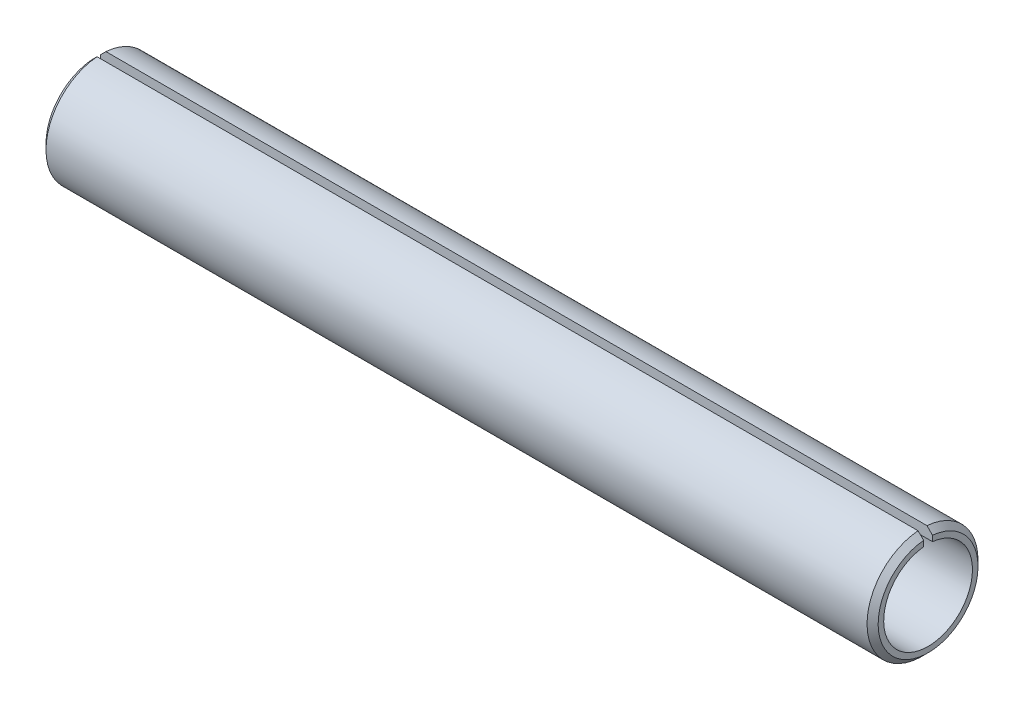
from build123d import *

# Parameters (mm, degrees)
ENL_V_MAT_EXTRU_2_DEPTH = 16.066519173


with BuildPart() as part:
    # Esquisse1 → Base-R_volution (revolve)
    with BuildSketch(Plane.XY):
        Polygon((0, 0.8), (0, 0.9), (0.1, 1), (14.9, 1), (15, 0.9), (15, 0.8), align=None)
    revolve(axis=Axis((0, 0, 0), (1, 0, 0)))

    # Esquisse2 → Enl_v. mat.-Extru.2 (cut, through all)
    with BuildSketch(Plane(origin=(0, 0, 0), x_dir=(0, 0, -1), z_dir=(1, 0, 0))):
        with BuildLine():
            Line((0.08, 0.996794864), (0.08, 0.79598995))
            ThreePointArc((0.08, 0.79598995), (0, 0.8), (-0.08, 0.79598995))
            Line((-0.08, 0.79598995), (-0.08, 0.996794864))
            ThreePointArc((-0.08, 0.996794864), (0, 1), (0.08, 0.996794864))
        make_face()
    extrude(amount=ENL_V_MAT_EXTRU_2_DEPTH, mode=Mode.SUBTRACT)


solid = part.part
